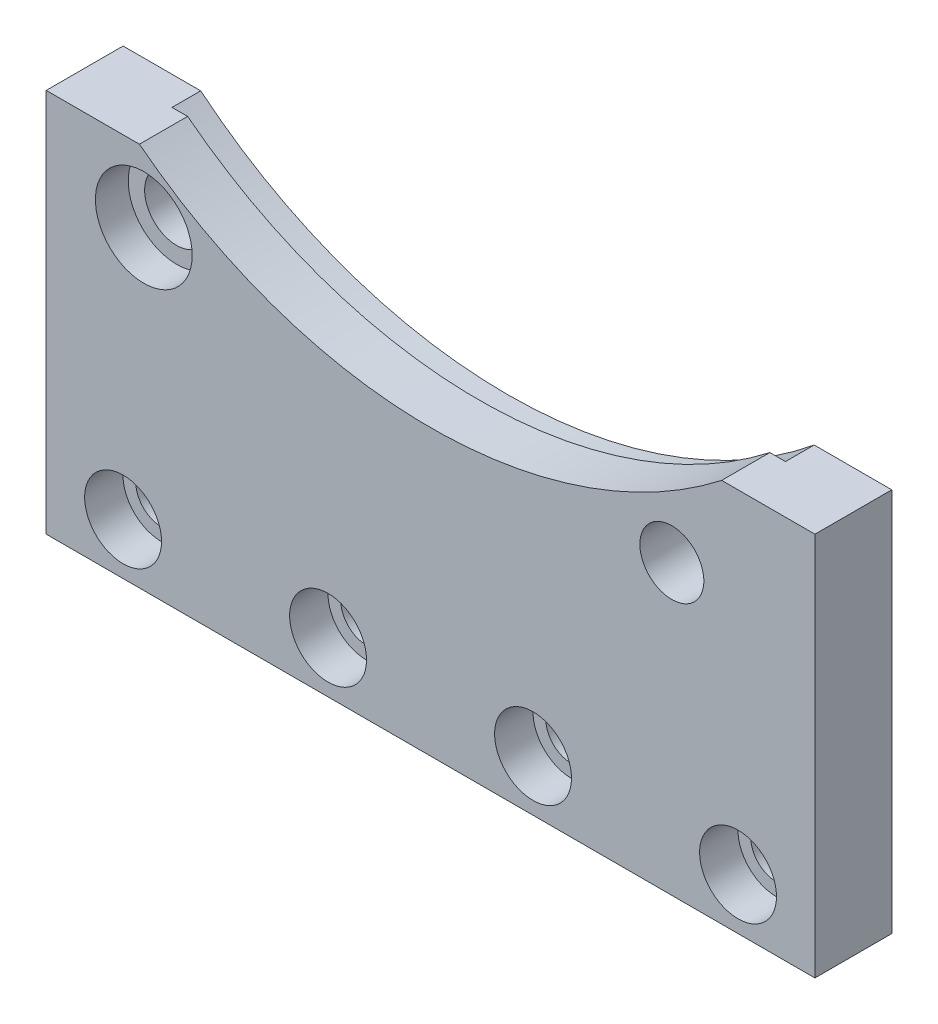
from build123d import *

# Parameters (mm, degrees)
SKETCH2_R           = 3.175
SKETCH2_R_2         = 3.9624
BOSS_EXTRUDE1_DEPTH = 9.525
SKETCH4_R           = 58.7375
CUT_EXTRUDE1_DEPTH  = 14.605
CUT_EXTRUDE2_START  = 4.7752
SKETCH5_R           = 4.7625
CUT_EXTRUDE2_DEPTH  = 10.16
SKETCH6_R           = 59.944
CUT_EXTRUDE3_DEPTH  = 3.556
SKETCH7_R           = 5.9944
CUT_EXTRUDE4_DEPTH  = 4.064


with BuildPart() as part:
    # Sketch2 → Boss-Extrude1 (new body)
    with BuildSketch(Plane.XY):
        Polygon((-47.625, 0), (0, 0), (47.625, 0), (47.625, 47.625), (-47.625, 47.625), align=None)
        with Locations(Location((-38.1, 6.35, 0), (0, 0, 180))):
            Circle(SKETCH2_R, mode=Mode.SUBTRACT)
        with Locations(Location((-12.7, 6.35, 0), (0, 0, 180))):
            Circle(SKETCH2_R, mode=Mode.SUBTRACT)
        with Locations(Location((12.7, 6.35, 0), (0, 0, 180))):
            Circle(SKETCH2_R, mode=Mode.SUBTRACT)
        with Locations(Location((38.1, 6.35, 0), (0, 0, 180))):
            Circle(SKETCH2_R, mode=Mode.SUBTRACT)
        with Locations(Location((29.8958, 35.7124, 0), (0, 0, 180))):
            Circle(SKETCH2_R_2, mode=Mode.SUBTRACT)
        with Locations(Location((-35.5346, 38.9636, 0), (0, 0, 180))):
            Circle(SKETCH2_R_2, mode=Mode.SUBTRACT)
    extrude(amount=BOSS_EXTRUDE1_DEPTH)

    # Sketch4 → Cut-Extrude1 (cut)
    with BuildSketch(Plane.XY):
        with Locations((0, 93.98)):
            Circle(SKETCH4_R)
    extrude(amount=CUT_EXTRUDE1_DEPTH, mode=Mode.SUBTRACT)

    # Sketch5 → Cut-Extrude2 (cut)
    with BuildSketch(Plane.XY.offset(CUT_EXTRUDE2_START)):
        with Locations((-38.1, 6.35)):
            Circle(SKETCH5_R)
        with Locations((-12.7, 6.35)):
            Circle(SKETCH5_R)
        with Locations((12.7, 6.35)):
            Circle(SKETCH5_R)
        with Locations((38.1, 6.35)):
            Circle(SKETCH5_R)
    extrude(amount=CUT_EXTRUDE2_DEPTH, mode=Mode.SUBTRACT)

    # Sketch6 → Cut-Extrude3 (cut)
    with BuildSketch(Plane.XY):
        with Locations((0, 93.98)):
            Circle(SKETCH6_R)
    extrude(amount=CUT_EXTRUDE3_DEPTH, mode=Mode.SUBTRACT)

    # Sketch7 → Cut-Extrude4 (cut)
    with BuildSketch(Plane.XY.offset(9.525)):
        with Locations((-35.5346, 38.9636)):
            Circle(SKETCH7_R)
    extrude(amount=-CUT_EXTRUDE4_DEPTH, mode=Mode.SUBTRACT)


solid = part.part
